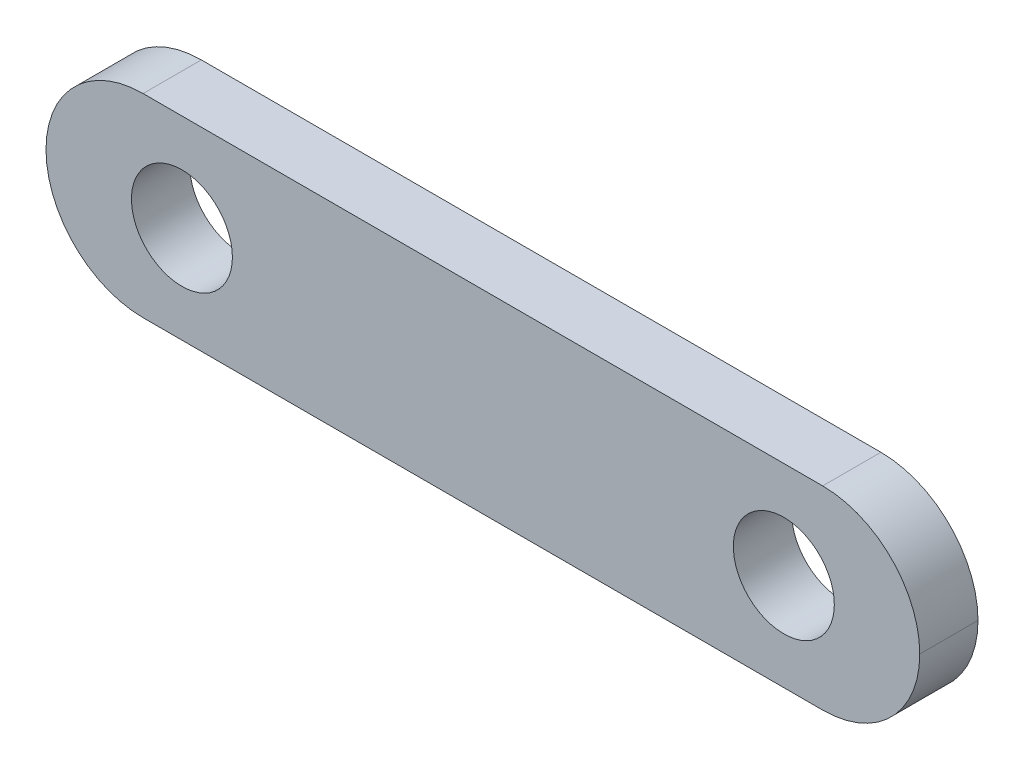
ISO-10303-21;
HEADER;
FILE_DESCRIPTION(('STEP AP214'),'2;1');
FILE_NAME('part.step','',(''),(''),'','','');
FILE_SCHEMA(('AUTOMOTIVE_DESIGN { 1 0 10303 214 1 1 1 1 }'));
ENDSEC;
DATA;
#1=APPLICATION_CONTEXT('core data for automotive mechanical design processes');
#2=APPLICATION_PROTOCOL_DEFINITION('international standard','automotive_design',2000,#1);
#3=PRODUCT_CONTEXT('',#1,'mechanical');
#4=PRODUCT('Part','Part','',(#3));
#5=PRODUCT_RELATED_PRODUCT_CATEGORY('part','',(#4));
#6=PRODUCT_DEFINITION_FORMATION('','',#4);
#7=PRODUCT_DEFINITION_CONTEXT('part definition',#1,'design');
#8=PRODUCT_DEFINITION('design','',#6,#7);
#9=PRODUCT_DEFINITION_SHAPE('','',#8);
#10=(LENGTH_UNIT() NAMED_UNIT(*) SI_UNIT(.MILLI.,.METRE.));
#11=(NAMED_UNIT(*) PLANE_ANGLE_UNIT() SI_UNIT($,.RADIAN.));
#12=(NAMED_UNIT(*) SI_UNIT($,.STERADIAN.) SOLID_ANGLE_UNIT());
#13=UNCERTAINTY_MEASURE_WITH_UNIT(LENGTH_MEASURE(1.E-05),#10,'distance_accuracy_value','');
#14=(GEOMETRIC_REPRESENTATION_CONTEXT(3) GLOBAL_UNCERTAINTY_ASSIGNED_CONTEXT((#13)) GLOBAL_UNIT_ASSIGNED_CONTEXT((#10,
#11,#12)) REPRESENTATION_CONTEXT('',''));
#15=CARTESIAN_POINT('',(0.,0.,0.));
#16=DIRECTION('',(0.,0.,1.));
#17=DIRECTION('',(1.,0.,0.));
#18=AXIS2_PLACEMENT_3D('',#15,#16,#17);
#19=CARTESIAN_POINT('',(-47.7032570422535,1.02306338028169,3.));
#20=DIRECTION('',(0.,1.,0.));
#21=DIRECTION('',(0.,0.,1.));
#22=AXIS2_PLACEMENT_3D('',#19,#20,#21);
#23=PLANE('',#22);
#24=DIRECTION('',(1.,0.,0.));
#25=VECTOR('',#24,1.);
#26=CARTESIAN_POINT('',(-47.7032570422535,1.02306338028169,3.));
#27=LINE('',#26,#25);
#28=CARTESIAN_POINT('',(-42.7032570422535,1.02306338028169,3.));
#29=VERTEX_POINT('',#28);
#30=CARTESIAN_POINT('',(-7.70325704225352,1.02306338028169,3.));
#31=VERTEX_POINT('',#30);
#32=EDGE_CURVE('E102',#29,#31,#27,.T.);
#33=ORIENTED_EDGE('',*,*,#32,.F.);
#34=DIRECTION('',(0.,0.,-1.));
#35=VECTOR('',#34,1.);
#36=CARTESIAN_POINT('',(-42.7032570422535,1.02306338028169,3.));
#37=LINE('',#36,#35);
#38=CARTESIAN_POINT('',(-42.7032570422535,1.02306338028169,0.));
#39=VERTEX_POINT('',#38);
#40=EDGE_CURVE('E86',#29,#39,#37,.T.);
#41=ORIENTED_EDGE('',*,*,#40,.T.);
#42=DIRECTION('',(1.,0.,0.));
#43=VECTOR('',#42,1.);
#44=CARTESIAN_POINT('',(-47.7032570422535,1.02306338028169,0.));
#45=LINE('',#44,#43);
#46=CARTESIAN_POINT('',(-7.70325704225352,1.02306338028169,0.));
#47=VERTEX_POINT('',#46);
#48=EDGE_CURVE('E99',#39,#47,#45,.T.);
#49=ORIENTED_EDGE('',*,*,#48,.T.);
#50=DIRECTION('',(0.,0.,-1.));
#51=VECTOR('',#50,1.);
#52=CARTESIAN_POINT('',(-7.7032570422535,1.02306338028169,3.));
#53=LINE('',#52,#51);
#54=EDGE_CURVE('E103',#47,#31,#53,.F.);
#55=ORIENTED_EDGE('',*,*,#54,.T.);
#56=EDGE_LOOP('',(#33,#41,#49,#55));
#57=FACE_BOUND('',#56,.T.);
#58=ADVANCED_FACE('F31',(#57),#23,.F.);
#59=CARTESIAN_POINT('',(-47.7032570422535,11.0230633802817,3.));
#60=DIRECTION('',(0.,-1.,0.));
#61=DIRECTION('',(0.,0.,-1.));
#62=AXIS2_PLACEMENT_3D('',#59,#60,#61);
#63=PLANE('',#62);
#64=DIRECTION('',(-1.,0.,0.));
#65=VECTOR('',#64,1.);
#66=CARTESIAN_POINT('',(-47.7032570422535,11.0230633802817,3.));
#67=LINE('',#66,#65);
#68=CARTESIAN_POINT('',(-7.70325704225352,11.0230633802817,3.));
#69=VERTEX_POINT('',#68);
#70=CARTESIAN_POINT('',(-42.7032570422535,11.0230633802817,3.));
#71=VERTEX_POINT('',#70);
#72=EDGE_CURVE('E118',#69,#71,#67,.T.);
#73=ORIENTED_EDGE('',*,*,#72,.F.);
#74=DIRECTION('',(0.,0.,-1.));
#75=VECTOR('',#74,1.);
#76=CARTESIAN_POINT('',(-7.7032570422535,11.0230633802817,3.));
#77=LINE('',#76,#75);
#78=CARTESIAN_POINT('',(-7.70325704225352,11.0230633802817,0.));
#79=VERTEX_POINT('',#78);
#80=EDGE_CURVE('E11',#69,#79,#77,.T.);
#81=ORIENTED_EDGE('',*,*,#80,.T.);
#82=DIRECTION('',(-1.,0.,0.));
#83=VECTOR('',#82,1.);
#84=CARTESIAN_POINT('',(-47.7032570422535,11.0230633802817,0.));
#85=LINE('',#84,#83);
#86=CARTESIAN_POINT('',(-42.7032570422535,11.0230633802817,0.));
#87=VERTEX_POINT('',#86);
#88=EDGE_CURVE('E108',#79,#87,#85,.T.);
#89=ORIENTED_EDGE('',*,*,#88,.T.);
#90=DIRECTION('',(0.,0.,-1.));
#91=VECTOR('',#90,1.);
#92=CARTESIAN_POINT('',(-42.7032570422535,11.0230633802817,3.));
#93=LINE('',#92,#91);
#94=EDGE_CURVE('E38',#87,#71,#93,.F.);
#95=ORIENTED_EDGE('',*,*,#94,.T.);
#96=EDGE_LOOP('',(#73,#81,#89,#95));
#97=FACE_BOUND('',#96,.T.);
#98=ADVANCED_FACE('F154',(#97),#63,.F.);
#99=CARTESIAN_POINT('',(-47.7032570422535,1.02306338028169,3.));
#100=DIRECTION('',(0.,0.,1.));
#101=DIRECTION('',(1.,0.,0.));
#102=AXIS2_PLACEMENT_3D('',#99,#100,#101);
#103=PLANE('',#102);
#104=CARTESIAN_POINT('',(-9.70325704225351,6.02306338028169,3.));
#105=DIRECTION('',(0.,0.,1.));
#106=DIRECTION('',(1.,0.,0.));
#107=AXIS2_PLACEMENT_3D('',#104,#105,#106);
#108=CIRCLE('',#107,2.6);
#109=CARTESIAN_POINT('',(-7.10325704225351,6.02306338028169,3.));
#110=VERTEX_POINT('',#109);
#111=EDGE_CURVE('E141',#110,#110,#108,.T.);
#112=ORIENTED_EDGE('',*,*,#111,.F.);
#113=EDGE_LOOP('',(#112));
#114=FACE_BOUND('',#113,.T.);
#115=CARTESIAN_POINT('',(-40.7032570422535,6.02306338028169,3.));
#116=DIRECTION('',(0.,0.,1.));
#117=DIRECTION('',(1.,0.,0.));
#118=AXIS2_PLACEMENT_3D('',#115,#116,#117);
#119=CIRCLE('',#118,2.6);
#120=CARTESIAN_POINT('',(-38.1032570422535,6.02306338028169,3.));
#121=VERTEX_POINT('',#120);
#122=EDGE_CURVE('E113',#121,#121,#119,.T.);
#123=ORIENTED_EDGE('',*,*,#122,.F.);
#124=EDGE_LOOP('',(#123));
#125=FACE_BOUND('',#124,.T.);
#126=ORIENTED_EDGE('',*,*,#32,.T.);
#127=CARTESIAN_POINT('',(-7.70325704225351,6.02306338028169,3.));
#128=DIRECTION('',(0.,0.,1.));
#129=DIRECTION('',(1.,0.,0.));
#130=AXIS2_PLACEMENT_3D('',#127,#128,#129);
#131=CIRCLE('',#130,5.);
#132=CARTESIAN_POINT('',(-2.70325704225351,6.02306338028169,3.));
#133=VERTEX_POINT('',#132);
#134=EDGE_CURVE('E129',#31,#133,#131,.T.);
#135=ORIENTED_EDGE('',*,*,#134,.T.);
#136=CARTESIAN_POINT('',(-7.7032570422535,6.02306338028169,3.));
#137=DIRECTION('',(0.,0.,1.));
#138=DIRECTION('',(1.,0.,0.));
#139=AXIS2_PLACEMENT_3D('',#136,#137,#138);
#140=CIRCLE('',#139,5.);
#141=EDGE_CURVE('E51',#133,#69,#140,.T.);
#142=ORIENTED_EDGE('',*,*,#141,.T.);
#143=ORIENTED_EDGE('',*,*,#72,.T.);
#144=CARTESIAN_POINT('',(-42.7032570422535,6.02306338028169,3.));
#145=DIRECTION('',(0.,0.,1.));
#146=DIRECTION('',(1.,0.,0.));
#147=AXIS2_PLACEMENT_3D('',#144,#145,#146);
#148=CIRCLE('',#147,5.);
#149=CARTESIAN_POINT('',(-47.7032570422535,6.02306338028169,3.));
#150=VERTEX_POINT('',#149);
#151=EDGE_CURVE('E124',#71,#150,#148,.T.);
#152=ORIENTED_EDGE('',*,*,#151,.T.);
#153=CARTESIAN_POINT('',(-42.7032570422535,6.02306338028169,3.));
#154=DIRECTION('',(0.,0.,1.));
#155=DIRECTION('',(1.,0.,0.));
#156=AXIS2_PLACEMENT_3D('',#153,#154,#155);
#157=CIRCLE('',#156,5.);
#158=EDGE_CURVE('E126',#150,#29,#157,.T.);
#159=ORIENTED_EDGE('',*,*,#158,.T.);
#160=EDGE_LOOP('',(#126,#135,#142,#143,#152,#159));
#161=FACE_BOUND('',#160,.T.);
#162=ADVANCED_FACE('F130',(#114,#125,#161),#103,.T.);
#163=CARTESIAN_POINT('',(-47.7032570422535,1.02306338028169,0.));
#164=DIRECTION('',(0.,0.,1.));
#165=DIRECTION('',(1.,0.,0.));
#166=AXIS2_PLACEMENT_3D('',#163,#164,#165);
#167=PLANE('',#166);
#168=CARTESIAN_POINT('',(-9.70325704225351,6.02306338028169,0.));
#169=DIRECTION('',(0.,0.,1.));
#170=DIRECTION('',(1.,0.,0.));
#171=AXIS2_PLACEMENT_3D('',#168,#169,#170);
#172=CIRCLE('',#171,2.6);
#173=CARTESIAN_POINT('',(-7.10325704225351,6.02306338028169,0.));
#174=VERTEX_POINT('',#173);
#175=EDGE_CURVE('E146',#174,#174,#172,.T.);
#176=ORIENTED_EDGE('',*,*,#175,.T.);
#177=EDGE_LOOP('',(#176));
#178=FACE_BOUND('',#177,.T.);
#179=CARTESIAN_POINT('',(-40.7032570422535,6.02306338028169,0.));
#180=DIRECTION('',(0.,0.,1.));
#181=DIRECTION('',(1.,0.,0.));
#182=AXIS2_PLACEMENT_3D('',#179,#180,#181);
#183=CIRCLE('',#182,2.6);
#184=CARTESIAN_POINT('',(-38.1032570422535,6.02306338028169,0.));
#185=VERTEX_POINT('',#184);
#186=EDGE_CURVE('E109',#185,#185,#183,.T.);
#187=ORIENTED_EDGE('',*,*,#186,.T.);
#188=EDGE_LOOP('',(#187));
#189=FACE_BOUND('',#188,.T.);
#190=CARTESIAN_POINT('',(-7.7032570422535,6.02306338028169,0.));
#191=DIRECTION('',(0.,0.,1.));
#192=DIRECTION('',(1.,0.,0.));
#193=AXIS2_PLACEMENT_3D('',#190,#191,#192);
#194=CIRCLE('',#193,5.);
#195=CARTESIAN_POINT('',(-2.70325704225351,6.02306338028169,0.));
#196=VERTEX_POINT('',#195);
#197=EDGE_CURVE('E92',#79,#196,#194,.F.);
#198=ORIENTED_EDGE('',*,*,#197,.T.);
#199=CARTESIAN_POINT('',(-7.70325704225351,6.02306338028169,0.));
#200=DIRECTION('',(0.,0.,1.));
#201=DIRECTION('',(1.,0.,0.));
#202=AXIS2_PLACEMENT_3D('',#199,#200,#201);
#203=CIRCLE('',#202,5.);
#204=EDGE_CURVE('E107',#196,#47,#203,.F.);
#205=ORIENTED_EDGE('',*,*,#204,.T.);
#206=ORIENTED_EDGE('',*,*,#48,.F.);
#207=CARTESIAN_POINT('',(-42.7032570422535,6.02306338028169,0.));
#208=DIRECTION('',(0.,0.,1.));
#209=DIRECTION('',(1.,0.,0.));
#210=AXIS2_PLACEMENT_3D('',#207,#208,#209);
#211=CIRCLE('',#210,5.);
#212=CARTESIAN_POINT('',(-47.7032570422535,6.02306338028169,0.));
#213=VERTEX_POINT('',#212);
#214=EDGE_CURVE('E82',#39,#213,#211,.F.);
#215=ORIENTED_EDGE('',*,*,#214,.T.);
#216=CARTESIAN_POINT('',(-42.7032570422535,6.02306338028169,0.));
#217=DIRECTION('',(0.,0.,1.));
#218=DIRECTION('',(1.,0.,0.));
#219=AXIS2_PLACEMENT_3D('',#216,#217,#218);
#220=CIRCLE('',#219,5.);
#221=EDGE_CURVE('E93',#213,#87,#220,.F.);
#222=ORIENTED_EDGE('',*,*,#221,.T.);
#223=ORIENTED_EDGE('',*,*,#88,.F.);
#224=EDGE_LOOP('',(#198,#205,#206,#215,#222,#223));
#225=FACE_BOUND('',#224,.T.);
#226=ADVANCED_FACE('F105',(#178,#189,#225),#167,.F.);
#227=CARTESIAN_POINT('',(-40.7032570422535,6.02306338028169,0.));
#228=DIRECTION('',(0.,0.,1.));
#229=DIRECTION('',(1.,0.,0.));
#230=AXIS2_PLACEMENT_3D('',#227,#228,#229);
#231=CYLINDRICAL_SURFACE('',#230,2.6);
#232=ORIENTED_EDGE('',*,*,#186,.F.);
#233=EDGE_LOOP('',(#232));
#234=FACE_BOUND('',#233,.T.);
#235=ORIENTED_EDGE('',*,*,#122,.T.);
#236=EDGE_LOOP('',(#235));
#237=FACE_BOUND('',#236,.T.);
#238=ADVANCED_FACE('F151',(#234,#237),#231,.F.);
#239=CARTESIAN_POINT('',(-9.70325704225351,6.02306338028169,0.));
#240=DIRECTION('',(0.,0.,1.));
#241=DIRECTION('',(1.,0.,0.));
#242=AXIS2_PLACEMENT_3D('',#239,#240,#241);
#243=CYLINDRICAL_SURFACE('',#242,2.6);
#244=ORIENTED_EDGE('',*,*,#175,.F.);
#245=EDGE_LOOP('',(#244));
#246=FACE_BOUND('',#245,.T.);
#247=ORIENTED_EDGE('',*,*,#111,.T.);
#248=EDGE_LOOP('',(#247));
#249=FACE_BOUND('',#248,.T.);
#250=ADVANCED_FACE('F171',(#246,#249),#243,.F.);
#251=CARTESIAN_POINT('',(-42.7032570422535,6.02306338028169,3.));
#252=DIRECTION('',(0.,0.,-1.));
#253=DIRECTION('',(-1.,0.,0.));
#254=AXIS2_PLACEMENT_3D('',#251,#252,#253);
#255=CYLINDRICAL_SURFACE('',#254,5.);
#256=DIRECTION('',(0.,0.,-1.));
#257=VECTOR('',#256,1.);
#258=CARTESIAN_POINT('',(-47.7032570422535,6.02306338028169,3.));
#259=LINE('',#258,#257);
#260=EDGE_CURVE('E88',#150,#213,#259,.T.);
#261=ORIENTED_EDGE('',*,*,#260,.F.);
#262=ORIENTED_EDGE('',*,*,#151,.F.);
#263=ORIENTED_EDGE('',*,*,#94,.F.);
#264=ORIENTED_EDGE('',*,*,#221,.F.);
#265=EDGE_LOOP('',(#261,#262,#263,#264));
#266=FACE_BOUND('',#265,.T.);
#267=ADVANCED_FACE('F194',(#266),#255,.T.);
#268=CARTESIAN_POINT('',(-42.7032570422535,6.02306338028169,3.));
#269=DIRECTION('',(0.,0.,-1.));
#270=DIRECTION('',(-1.,0.,0.));
#271=AXIS2_PLACEMENT_3D('',#268,#269,#270);
#272=CYLINDRICAL_SURFACE('',#271,5.);
#273=ORIENTED_EDGE('',*,*,#158,.F.);
#274=ORIENTED_EDGE('',*,*,#260,.T.);
#275=ORIENTED_EDGE('',*,*,#214,.F.);
#276=ORIENTED_EDGE('',*,*,#40,.F.);
#277=EDGE_LOOP('',(#273,#274,#275,#276));
#278=FACE_BOUND('',#277,.T.);
#279=ADVANCED_FACE('F85',(#278),#272,.T.);
#280=CARTESIAN_POINT('',(-7.7032570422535,6.02306338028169,3.));
#281=DIRECTION('',(0.,0.,-1.));
#282=DIRECTION('',(-1.,0.,0.));
#283=AXIS2_PLACEMENT_3D('',#280,#281,#282);
#284=CYLINDRICAL_SURFACE('',#283,5.);
#285=ORIENTED_EDGE('',*,*,#80,.F.);
#286=ORIENTED_EDGE('',*,*,#141,.F.);
#287=DIRECTION('',(0.,0.,-1.));
#288=VECTOR('',#287,1.);
#289=CARTESIAN_POINT('',(-2.70325704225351,6.02306338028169,3.));
#290=LINE('',#289,#288);
#291=EDGE_CURVE('E138',#196,#133,#290,.F.);
#292=ORIENTED_EDGE('',*,*,#291,.F.);
#293=ORIENTED_EDGE('',*,*,#197,.F.);
#294=EDGE_LOOP('',(#285,#286,#292,#293));
#295=FACE_BOUND('',#294,.T.);
#296=ADVANCED_FACE('F136',(#295),#284,.T.);
#297=CARTESIAN_POINT('',(-7.70325704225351,6.02306338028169,3.));
#298=DIRECTION('',(0.,0.,-1.));
#299=DIRECTION('',(-1.,0.,0.));
#300=AXIS2_PLACEMENT_3D('',#297,#298,#299);
#301=CYLINDRICAL_SURFACE('',#300,5.);
#302=ORIENTED_EDGE('',*,*,#134,.F.);
#303=ORIENTED_EDGE('',*,*,#54,.F.);
#304=ORIENTED_EDGE('',*,*,#204,.F.);
#305=ORIENTED_EDGE('',*,*,#291,.T.);
#306=EDGE_LOOP('',(#302,#303,#304,#305));
#307=FACE_BOUND('',#306,.T.);
#308=ADVANCED_FACE('F139',(#307),#301,.T.);
#309=CLOSED_SHELL('',(#58,#98,#162,#226,#238,#250,#267,#279,#296,#308));
#310=MANIFOLD_SOLID_BREP('B2',#309);
#311=ADVANCED_BREP_SHAPE_REPRESENTATION('',(#18,#310),#14);
#312=SHAPE_DEFINITION_REPRESENTATION(#9,#311);
ENDSEC;
END-ISO-10303-21;
